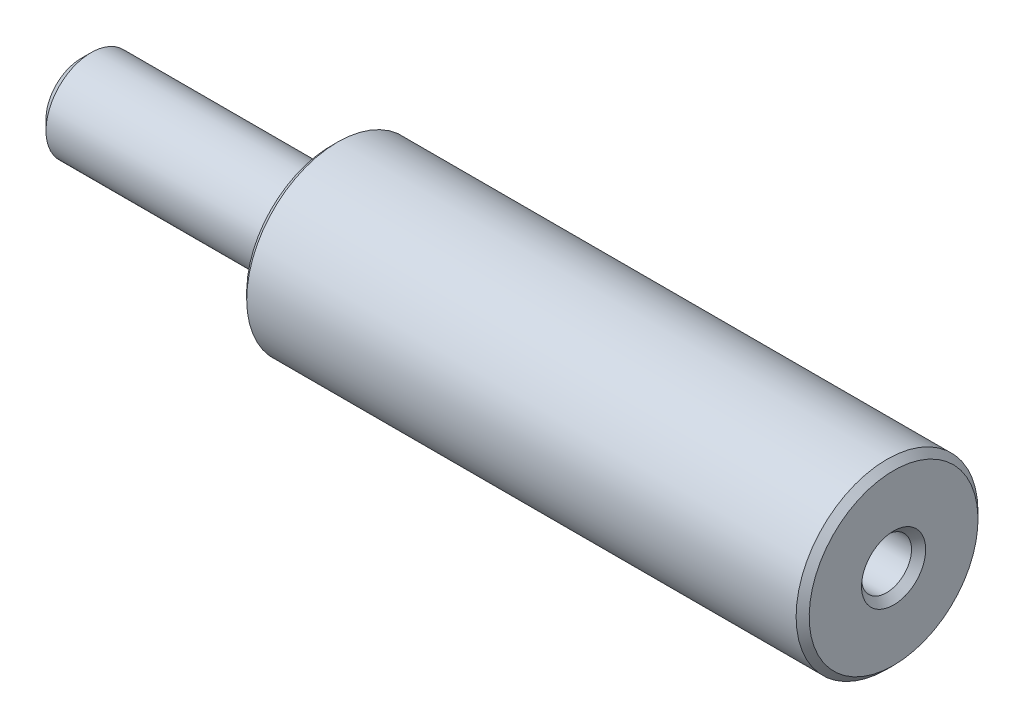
ISO-10303-21;
HEADER;
FILE_DESCRIPTION(('STEP AP214'),'2;1');
FILE_NAME('part.step','',(''),(''),'','','');
FILE_SCHEMA(('AUTOMOTIVE_DESIGN { 1 0 10303 214 1 1 1 1 }'));
ENDSEC;
DATA;
#1=APPLICATION_CONTEXT('core data for automotive mechanical design processes');
#2=APPLICATION_PROTOCOL_DEFINITION('international standard','automotive_design',2000,#1);
#3=PRODUCT_CONTEXT('',#1,'mechanical');
#4=PRODUCT('Part','Part','',(#3));
#5=PRODUCT_RELATED_PRODUCT_CATEGORY('part','',(#4));
#6=PRODUCT_DEFINITION_FORMATION('','',#4);
#7=PRODUCT_DEFINITION_CONTEXT('part definition',#1,'design');
#8=PRODUCT_DEFINITION('design','',#6,#7);
#9=PRODUCT_DEFINITION_SHAPE('','',#8);
#10=(LENGTH_UNIT() NAMED_UNIT(*) SI_UNIT(.MILLI.,.METRE.));
#11=(NAMED_UNIT(*) PLANE_ANGLE_UNIT() SI_UNIT($,.RADIAN.));
#12=(NAMED_UNIT(*) SI_UNIT($,.STERADIAN.) SOLID_ANGLE_UNIT());
#13=UNCERTAINTY_MEASURE_WITH_UNIT(LENGTH_MEASURE(1.E-05),#10,'distance_accuracy_value','');
#14=(GEOMETRIC_REPRESENTATION_CONTEXT(3) GLOBAL_UNCERTAINTY_ASSIGNED_CONTEXT((#13)) GLOBAL_UNIT_ASSIGNED_CONTEXT((#10,
#11,#12)) REPRESENTATION_CONTEXT('',''));
#15=CARTESIAN_POINT('',(0.,0.,0.));
#16=DIRECTION('',(0.,0.,1.));
#17=DIRECTION('',(1.,0.,0.));
#18=AXIS2_PLACEMENT_3D('',#15,#16,#17);
#19=CARTESIAN_POINT('',(45.0000000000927,1.98818536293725E-11,0.));
#20=DIRECTION('',(-1.,0.,0.));
#21=DIRECTION('',(0.,-1.,0.));
#22=AXIS2_PLACEMENT_3D('',#19,#20,#21);
#23=CYLINDRICAL_SURFACE('',#22,2.);
#24=CARTESIAN_POINT('',(26.6017140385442,1.98813626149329E-11,0.));
#25=DIRECTION('',(-1.,0.,0.));
#26=DIRECTION('',(0.,-1.,0.));
#27=AXIS2_PLACEMENT_3D('',#24,#25,#26);
#28=CIRCLE('',#27,2.);
#29=CARTESIAN_POINT('',(26.6017140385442,-1.99999999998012,0.));
#30=VERTEX_POINT('',#29);
#31=EDGE_CURVE('E48',#30,#30,#28,.T.);
#32=ORIENTED_EDGE('',*,*,#31,.T.);
#33=EDGE_LOOP('',(#32));
#34=FACE_BOUND('',#33,.T.);
#35=CARTESIAN_POINT('',(44.4333139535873,1.9881838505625E-11,0.));
#36=DIRECTION('',(-1.,0.,0.));
#37=DIRECTION('',(0.,-1.,0.));
#38=AXIS2_PLACEMENT_3D('',#35,#36,#37);
#39=CIRCLE('',#38,2.);
#40=CARTESIAN_POINT('',(44.4333139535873,-1.99999999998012,0.));
#41=VERTEX_POINT('',#40);
#42=EDGE_CURVE('E11',#41,#41,#39,.T.);
#43=ORIENTED_EDGE('',*,*,#42,.F.);
#44=EDGE_LOOP('',(#43));
#45=FACE_BOUND('',#44,.T.);
#46=ADVANCED_FACE('F32',(#34,#45),#23,.F.);
#47=CARTESIAN_POINT('',(45.0000000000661,1.98818536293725E-11,0.));
#48=DIRECTION('',(1.,0.,0.));
#49=DIRECTION('',(0.,1.,0.));
#50=AXIS2_PLACEMENT_3D('',#47,#48,#49);
#51=CONICAL_SURFACE('',#50,2.56668604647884,0.785398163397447);
#52=ORIENTED_EDGE('',*,*,#42,.T.);
#53=EDGE_LOOP('',(#52));
#54=FACE_BOUND('',#53,.T.);
#55=CARTESIAN_POINT('',(45.0000000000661,1.98818536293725E-11,0.));
#56=DIRECTION('',(-1.,0.,0.));
#57=DIRECTION('',(0.,-1.,0.));
#58=AXIS2_PLACEMENT_3D('',#55,#56,#57);
#59=CIRCLE('',#58,2.56668604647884);
#60=CARTESIAN_POINT('',(45.0000000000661,-2.56668604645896,0.));
#61=VERTEX_POINT('',#60);
#62=EDGE_CURVE('E38',#61,#61,#59,.T.);
#63=ORIENTED_EDGE('',*,*,#62,.F.);
#64=EDGE_LOOP('',(#63));
#65=FACE_BOUND('',#64,.T.);
#66=ADVANCED_FACE('F81',(#54,#65),#51,.F.);
#67=CARTESIAN_POINT('',(45.0000000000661,6.75273255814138,0.));
#68=DIRECTION('',(1.,0.,0.));
#69=DIRECTION('',(0.,1.,0.));
#70=AXIS2_PLACEMENT_3D('',#67,#68,#69);
#71=PLANE('',#70);
#72=ORIENTED_EDGE('',*,*,#62,.T.);
#73=EDGE_LOOP('',(#72));
#74=FACE_BOUND('',#73,.T.);
#75=CARTESIAN_POINT('',(45.0000000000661,1.98818536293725E-11,0.));
#76=DIRECTION('',(-1.,0.,0.));
#77=DIRECTION('',(0.,-1.,0.));
#78=AXIS2_PLACEMENT_3D('',#75,#76,#77);
#79=CIRCLE('',#78,6.7527325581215);
#80=CARTESIAN_POINT('',(45.0000000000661,-6.75273255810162,0.));
#81=VERTEX_POINT('',#80);
#82=EDGE_CURVE('E73',#81,#81,#79,.T.);
#83=ORIENTED_EDGE('',*,*,#82,.F.);
#84=EDGE_LOOP('',(#83));
#85=FACE_BOUND('',#84,.T.);
#86=ADVANCED_FACE('F78',(#74,#85),#71,.T.);
#87=CARTESIAN_POINT('',(44.4767441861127,1.98818396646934E-11,0.));
#88=DIRECTION('',(-1.,0.,0.));
#89=DIRECTION('',(0.,-1.,0.));
#90=AXIS2_PLACEMENT_3D('',#87,#88,#89);
#91=CONICAL_SURFACE('',#90,7.27598837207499,0.785398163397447);
#92=ORIENTED_EDGE('',*,*,#82,.T.);
#93=EDGE_LOOP('',(#92));
#94=FACE_BOUND('',#93,.T.);
#95=CARTESIAN_POINT('',(44.4767441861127,1.98818396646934E-11,0.));
#96=DIRECTION('',(-1.,0.,0.));
#97=DIRECTION('',(0.,-1.,0.));
#98=AXIS2_PLACEMENT_3D('',#95,#96,#97);
#99=CIRCLE('',#98,7.27598837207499);
#100=CARTESIAN_POINT('',(44.4767441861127,-7.27598837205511,0.));
#101=VERTEX_POINT('',#100);
#102=EDGE_CURVE('E70',#101,#101,#99,.T.);
#103=ORIENTED_EDGE('',*,*,#102,.F.);
#104=EDGE_LOOP('',(#103));
#105=FACE_BOUND('',#104,.T.);
#106=ADVANCED_FACE('F88',(#94,#105),#91,.T.);
#107=CARTESIAN_POINT('',(45.0000000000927,1.98818536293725E-11,0.));
#108=DIRECTION('',(-1.,0.,0.));
#109=DIRECTION('',(0.,-1.,0.));
#110=AXIS2_PLACEMENT_3D('',#107,#108,#109);
#111=CYLINDRICAL_SURFACE('',#110,7.27598837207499);
#112=ORIENTED_EDGE('',*,*,#102,.T.);
#113=EDGE_LOOP('',(#112));
#114=FACE_BOUND('',#113,.T.);
#115=CARTESIAN_POINT('',(0.523255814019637,1.98806666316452E-11,0.));
#116=DIRECTION('',(-1.,0.,0.));
#117=DIRECTION('',(0.,-1.,0.));
#118=AXIS2_PLACEMENT_3D('',#115,#116,#117);
#119=CIRCLE('',#118,7.275988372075);
#120=CARTESIAN_POINT('',(0.523255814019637,-7.27598837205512,0.));
#121=VERTEX_POINT('',#120);
#122=EDGE_CURVE('E67',#121,#121,#119,.T.);
#123=ORIENTED_EDGE('',*,*,#122,.F.);
#124=EDGE_LOOP('',(#123));
#125=FACE_BOUND('',#124,.T.);
#126=ADVANCED_FACE('F93',(#114,#125),#111,.T.);
#127=CARTESIAN_POINT('',(6.61484755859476E-11,1.98806526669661E-11,0.));
#128=DIRECTION('',(1.,0.,0.));
#129=DIRECTION('',(0.,1.,0.));
#130=AXIS2_PLACEMENT_3D('',#127,#128,#129);
#131=CONICAL_SURFACE('',#130,6.75273255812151,0.785398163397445);
#132=ORIENTED_EDGE('',*,*,#122,.T.);
#133=EDGE_LOOP('',(#132));
#134=FACE_BOUND('',#133,.T.);
#135=CARTESIAN_POINT('',(6.61484755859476E-11,1.98806526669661E-11,0.));
#136=DIRECTION('',(-1.,0.,0.));
#137=DIRECTION('',(0.,-1.,0.));
#138=AXIS2_PLACEMENT_3D('',#135,#136,#137);
#139=CIRCLE('',#138,6.75273255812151);
#140=CARTESIAN_POINT('',(6.61486558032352E-11,-6.75273255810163,0.));
#141=VERTEX_POINT('',#140);
#142=EDGE_CURVE('E64',#141,#141,#139,.T.);
#143=ORIENTED_EDGE('',*,*,#142,.F.);
#144=EDGE_LOOP('',(#143));
#145=FACE_BOUND('',#144,.T.);
#146=ADVANCED_FACE('F97',(#134,#145),#131,.T.);
#147=CARTESIAN_POINT('',(6.6150325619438E-11,3.92715116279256,0.));
#148=DIRECTION('',(-1.,0.,0.));
#149=DIRECTION('',(0.,-1.,0.));
#150=AXIS2_PLACEMENT_3D('',#147,#148,#149);
#151=PLANE('',#150);
#152=ORIENTED_EDGE('',*,*,#142,.T.);
#153=EDGE_LOOP('',(#152));
#154=FACE_BOUND('',#153,.T.);
#155=CARTESIAN_POINT('',(6.61484755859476E-11,1.98806526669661E-11,0.));
#156=DIRECTION('',(-1.,0.,0.));
#157=DIRECTION('',(0.,-1.,0.));
#158=AXIS2_PLACEMENT_3D('',#155,#156,#157);
#159=CIRCLE('',#158,3.92715116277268);
#160=CARTESIAN_POINT('',(6.61485803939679E-11,-3.9271511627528,0.));
#161=VERTEX_POINT('',#160);
#162=EDGE_CURVE('E61',#161,#161,#159,.T.);
#163=ORIENTED_EDGE('',*,*,#162,.F.);
#164=EDGE_LOOP('',(#163));
#165=FACE_BOUND('',#164,.T.);
#166=ADVANCED_FACE('F101',(#154,#165),#151,.T.);
#167=CARTESIAN_POINT('',(-0.313953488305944,1.98807983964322E-11,0.));
#168=DIRECTION('',(-1.,0.,0.));
#169=DIRECTION('',(0.,-1.,0.));
#170=AXIS2_PLACEMENT_3D('',#167,#168,#169);
#171=TOROIDAL_SURFACE('',#170,3.92715116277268,0.313953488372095);
#172=ORIENTED_EDGE('',*,*,#162,.T.);
#173=EDGE_LOOP('',(#172));
#174=FACE_BOUND('',#173,.T.);
#175=CARTESIAN_POINT('',(-0.313953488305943,1.98806442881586E-11,0.));
#176=DIRECTION('',(-1.,0.,0.));
#177=DIRECTION('',(0.,-1.,0.));
#178=AXIS2_PLACEMENT_3D('',#175,#176,#177);
#179=CIRCLE('',#178,3.61319767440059);
#180=CARTESIAN_POINT('',(-0.313953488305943,-3.61319767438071,0.));
#181=VERTEX_POINT('',#180);
#182=EDGE_CURVE('E58',#181,#181,#179,.T.);
#183=ORIENTED_EDGE('',*,*,#182,.F.);
#184=EDGE_LOOP('',(#183));
#185=FACE_BOUND('',#184,.T.);
#186=ADVANCED_FACE('F105',(#174,#185),#171,.F.);
#187=CARTESIAN_POINT('',(45.0000000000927,1.98818536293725E-11,0.));
#188=DIRECTION('',(-1.,0.,0.));
#189=DIRECTION('',(0.,-1.,0.));
#190=AXIS2_PLACEMENT_3D('',#187,#188,#189);
#191=CYLINDRICAL_SURFACE('',#190,3.61319767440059);
#192=ORIENTED_EDGE('',*,*,#182,.T.);
#193=EDGE_LOOP('',(#192));
#194=FACE_BOUND('',#193,.T.);
#195=CARTESIAN_POINT('',(-19.1973255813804,1.98801403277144E-11,0.));
#196=DIRECTION('',(-1.,0.,0.));
#197=DIRECTION('',(0.,-1.,0.));
#198=AXIS2_PLACEMENT_3D('',#195,#196,#197);
#199=CIRCLE('',#198,3.61319767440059);
#200=CARTESIAN_POINT('',(-19.1973255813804,-3.61319767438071,0.));
#201=VERTEX_POINT('',#200);
#202=EDGE_CURVE('E53',#201,#201,#199,.T.);
#203=ORIENTED_EDGE('',*,*,#202,.F.);
#204=EDGE_LOOP('',(#203));
#205=FACE_BOUND('',#204,.T.);
#206=ADVANCED_FACE('F109',(#194,#205),#191,.T.);
#207=CARTESIAN_POINT('',(-19.9999999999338,1.98801189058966E-11,0.));
#208=DIRECTION('',(1.,0.,0.));
#209=DIRECTION('',(0.,1.,0.));
#210=AXIS2_PLACEMENT_3D('',#207,#208,#209);
#211=CONICAL_SURFACE('',#210,2.81052325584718,0.78539816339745);
#212=ORIENTED_EDGE('',*,*,#202,.T.);
#213=EDGE_LOOP('',(#212));
#214=FACE_BOUND('',#213,.T.);
#215=CARTESIAN_POINT('',(-19.9999999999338,1.98801189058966E-11,0.));
#216=DIRECTION('',(-1.,0.,0.));
#217=DIRECTION('',(0.,-1.,0.));
#218=AXIS2_PLACEMENT_3D('',#215,#216,#217);
#219=CIRCLE('',#218,2.81052325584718);
#220=CARTESIAN_POINT('',(-19.9999999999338,-2.8105232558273,0.));
#221=VERTEX_POINT('',#220);
#222=EDGE_CURVE('E50',#221,#221,#219,.T.);
#223=ORIENTED_EDGE('',*,*,#222,.F.);
#224=EDGE_LOOP('',(#223));
#225=FACE_BOUND('',#224,.T.);
#226=ADVANCED_FACE('F113',(#214,#225),#211,.T.);
#227=CARTESIAN_POINT('',(-19.9999999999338,1.98801189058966E-11,0.));
#228=DIRECTION('',(-1.,0.,0.));
#229=DIRECTION('',(0.,-1.,0.));
#230=AXIS2_PLACEMENT_3D('',#227,#228,#229);
#231=PLANE('',#230);
#232=ORIENTED_EDGE('',*,*,#222,.T.);
#233=EDGE_LOOP('',(#232));
#234=FACE_BOUND('',#233,.T.);
#235=ADVANCED_FACE('F44',(#234),#231,.T.);
#236=CARTESIAN_POINT('',(26.6017140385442,1.98813626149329E-11,0.));
#237=DIRECTION('',(1.,0.,0.));
#238=DIRECTION('',(0.,1.,0.));
#239=AXIS2_PLACEMENT_3D('',#236,#237,#238);
#240=CONICAL_SURFACE('',#239,2.,0.931972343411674);
#241=CARTESIAN_POINT('',(25.1162790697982,1.98818536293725E-11,0.));
#242=VERTEX_POINT('',#241);
#243=VERTEX_LOOP('',#242);
#244=FACE_BOUND('',#243,.T.);
#245=ORIENTED_EDGE('',*,*,#31,.F.);
#246=EDGE_LOOP('',(#245));
#247=FACE_BOUND('',#246,.T.);
#248=ADVANCED_FACE('F41',(#244,#247),#240,.F.);
#249=CLOSED_SHELL('',(#46,#66,#86,#106,#126,#146,#166,#186,#206,#226,#235,#248));
#250=MANIFOLD_SOLID_BREP('B2',#249);
#251=ADVANCED_BREP_SHAPE_REPRESENTATION('',(#18,#250),#14);
#252=SHAPE_DEFINITION_REPRESENTATION(#9,#251);
ENDSEC;
END-ISO-10303-21;
